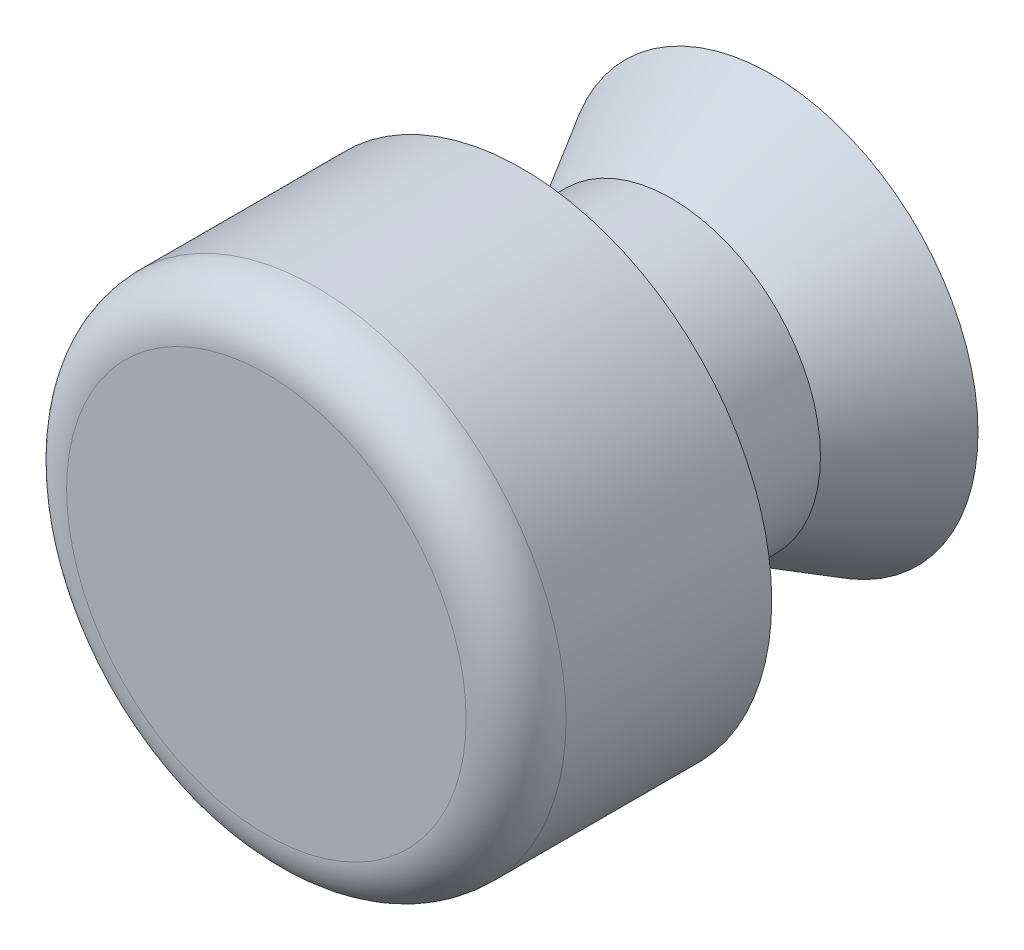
ISO-10303-21;
HEADER;
FILE_DESCRIPTION(('STEP AP214'),'2;1');
FILE_NAME('part.step','',(''),(''),'','','');
FILE_SCHEMA(('AUTOMOTIVE_DESIGN { 1 0 10303 214 1 1 1 1 }'));
ENDSEC;
DATA;
#1=APPLICATION_CONTEXT('core data for automotive mechanical design processes');
#2=APPLICATION_PROTOCOL_DEFINITION('international standard','automotive_design',2000,#1);
#3=PRODUCT_CONTEXT('',#1,'mechanical');
#4=PRODUCT('Part','Part','',(#3));
#5=PRODUCT_RELATED_PRODUCT_CATEGORY('part','',(#4));
#6=PRODUCT_DEFINITION_FORMATION('','',#4);
#7=PRODUCT_DEFINITION_CONTEXT('part definition',#1,'design');
#8=PRODUCT_DEFINITION('design','',#6,#7);
#9=PRODUCT_DEFINITION_SHAPE('','',#8);
#10=(LENGTH_UNIT() NAMED_UNIT(*) SI_UNIT(.MILLI.,.METRE.));
#11=(NAMED_UNIT(*) PLANE_ANGLE_UNIT() SI_UNIT($,.RADIAN.));
#12=(NAMED_UNIT(*) SI_UNIT($,.STERADIAN.) SOLID_ANGLE_UNIT());
#13=UNCERTAINTY_MEASURE_WITH_UNIT(LENGTH_MEASURE(1.E-05),#10,'distance_accuracy_value','');
#14=(GEOMETRIC_REPRESENTATION_CONTEXT(3) GLOBAL_UNCERTAINTY_ASSIGNED_CONTEXT((#13)) GLOBAL_UNIT_ASSIGNED_CONTEXT((#10,
#11,#12)) REPRESENTATION_CONTEXT('',''));
#15=CARTESIAN_POINT('',(0.,0.,0.));
#16=DIRECTION('',(0.,0.,1.));
#17=DIRECTION('',(1.,0.,0.));
#18=AXIS2_PLACEMENT_3D('',#15,#16,#17);
#19=CARTESIAN_POINT('',(0.,3.17499999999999,0.));
#20=DIRECTION('',(0.,0.,-1.));
#21=DIRECTION('',(-1.,0.,0.));
#22=AXIS2_PLACEMENT_3D('',#19,#20,#21);
#23=PLANE('',#22);
#24=CARTESIAN_POINT('',(0.,0.,0.));
#25=DIRECTION('',(0.,0.,1.));
#26=DIRECTION('',(1.,0.,0.));
#27=AXIS2_PLACEMENT_3D('',#24,#25,#26);
#28=CIRCLE('',#27,3.17499999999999);
#29=CARTESIAN_POINT('',(3.17499999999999,0.,0.));
#30=VERTEX_POINT('',#29);
#31=EDGE_CURVE('E55',#30,#30,#28,.T.);
#32=ORIENTED_EDGE('',*,*,#31,.T.);
#33=EDGE_LOOP('',(#32));
#34=FACE_BOUND('',#33,.T.);
#35=ADVANCED_FACE('F33',(#34),#23,.F.);
#36=CARTESIAN_POINT('',(0.,0.,-8.0264));
#37=DIRECTION('',(0.,0.,1.));
#38=DIRECTION('',(1.,0.,0.));
#39=AXIS2_PLACEMENT_3D('',#36,#37,#38);
#40=PLANE('',#39);
#41=CARTESIAN_POINT('',(0.,0.,-8.0264));
#42=DIRECTION('',(0.,0.,1.));
#43=DIRECTION('',(1.,0.,0.));
#44=AXIS2_PLACEMENT_3D('',#41,#42,#43);
#45=CIRCLE('',#44,3.28509355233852);
#46=CARTESIAN_POINT('',(3.28509355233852,0.,-8.0264));
#47=VERTEX_POINT('',#46);
#48=EDGE_CURVE('E10',#47,#47,#45,.T.);
#49=ORIENTED_EDGE('',*,*,#48,.F.);
#50=EDGE_LOOP('',(#49));
#51=FACE_BOUND('',#50,.T.);
#52=ADVANCED_FACE('F85',(#51),#40,.F.);
#53=CARTESIAN_POINT('',(0.,0.,-8.0264));
#54=DIRECTION('',(0.,0.,-1.));
#55=DIRECTION('',(-1.,0.,0.));
#56=AXIS2_PLACEMENT_3D('',#53,#54,#55);
#57=CONICAL_SURFACE('',#56,3.28509355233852,0.523598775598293);
#58=CARTESIAN_POINT('',(0.,0.,-6.4389));
#59=DIRECTION('',(0.,0.,1.));
#60=DIRECTION('',(1.,0.,0.));
#61=AXIS2_PLACEMENT_3D('',#58,#59,#60);
#62=CIRCLE('',#61,2.36855);
#63=CARTESIAN_POINT('',(2.36855,0.,-6.4389));
#64=VERTEX_POINT('',#63);
#65=EDGE_CURVE('E39',#64,#64,#62,.T.);
#66=ORIENTED_EDGE('',*,*,#65,.F.);
#67=EDGE_LOOP('',(#66));
#68=FACE_BOUND('',#67,.T.);
#69=ORIENTED_EDGE('',*,*,#48,.T.);
#70=EDGE_LOOP('',(#69));
#71=FACE_BOUND('',#70,.T.);
#72=ADVANCED_FACE('F80',(#68,#71),#57,.T.);
#73=CARTESIAN_POINT('',(0.,0.,0.));
#74=DIRECTION('',(0.,0.,1.));
#75=DIRECTION('',(1.,0.,0.));
#76=AXIS2_PLACEMENT_3D('',#73,#74,#75);
#77=CYLINDRICAL_SURFACE('',#76,2.36855);
#78=CARTESIAN_POINT('',(0.,0.,-4.064));
#79=DIRECTION('',(0.,0.,1.));
#80=DIRECTION('',(1.,0.,0.));
#81=AXIS2_PLACEMENT_3D('',#78,#79,#80);
#82=CIRCLE('',#81,2.36855);
#83=CARTESIAN_POINT('',(2.36855,0.,-4.064));
#84=VERTEX_POINT('',#83);
#85=EDGE_CURVE('E43',#84,#84,#82,.T.);
#86=ORIENTED_EDGE('',*,*,#85,.F.);
#87=EDGE_LOOP('',(#86));
#88=FACE_BOUND('',#87,.T.);
#89=ORIENTED_EDGE('',*,*,#65,.T.);
#90=EDGE_LOOP('',(#89));
#91=FACE_BOUND('',#90,.T.);
#92=ADVANCED_FACE('F75',(#88,#91),#77,.T.);
#93=CARTESIAN_POINT('',(0.,2.36855,-4.064));
#94=DIRECTION('',(0.,0.,1.));
#95=DIRECTION('',(1.,0.,0.));
#96=AXIS2_PLACEMENT_3D('',#93,#94,#95);
#97=PLANE('',#96);
#98=CARTESIAN_POINT('',(0.,0.,-4.064));
#99=DIRECTION('',(0.,0.,1.));
#100=DIRECTION('',(1.,0.,0.));
#101=AXIS2_PLACEMENT_3D('',#98,#99,#100);
#102=CIRCLE('',#101,3.96875);
#103=CARTESIAN_POINT('',(3.96875,0.,-4.064));
#104=VERTEX_POINT('',#103);
#105=EDGE_CURVE('E47',#104,#104,#102,.T.);
#106=ORIENTED_EDGE('',*,*,#105,.F.);
#107=EDGE_LOOP('',(#106));
#108=FACE_BOUND('',#107,.T.);
#109=ORIENTED_EDGE('',*,*,#85,.T.);
#110=EDGE_LOOP('',(#109));
#111=FACE_BOUND('',#110,.T.);
#112=ADVANCED_FACE('F69',(#108,#111),#97,.F.);
#113=CARTESIAN_POINT('',(0.,0.,0.));
#114=DIRECTION('',(0.,0.,1.));
#115=DIRECTION('',(1.,0.,0.));
#116=AXIS2_PLACEMENT_3D('',#113,#114,#115);
#117=CYLINDRICAL_SURFACE('',#116,3.96875);
#118=CARTESIAN_POINT('',(0.,0.,-0.793750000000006));
#119=DIRECTION('',(0.,0.,1.));
#120=DIRECTION('',(1.,0.,0.));
#121=AXIS2_PLACEMENT_3D('',#118,#119,#120);
#122=CIRCLE('',#121,3.96875);
#123=CARTESIAN_POINT('',(3.96875,0.,-0.793750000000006));
#124=VERTEX_POINT('',#123);
#125=EDGE_CURVE('E52',#124,#124,#122,.T.);
#126=ORIENTED_EDGE('',*,*,#125,.F.);
#127=EDGE_LOOP('',(#126));
#128=FACE_BOUND('',#127,.T.);
#129=ORIENTED_EDGE('',*,*,#105,.T.);
#130=EDGE_LOOP('',(#129));
#131=FACE_BOUND('',#130,.T.);
#132=ADVANCED_FACE('F63',(#128,#131),#117,.T.);
#133=CARTESIAN_POINT('',(0.,0.,-0.793750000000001));
#134=DIRECTION('',(0.,0.,1.));
#135=DIRECTION('',(1.,0.,0.));
#136=AXIS2_PLACEMENT_3D('',#133,#134,#135);
#137=TOROIDAL_SURFACE('',#136,3.175,0.79375);
#138=ORIENTED_EDGE('',*,*,#31,.F.);
#139=EDGE_LOOP('',(#138));
#140=FACE_BOUND('',#139,.T.);
#141=ORIENTED_EDGE('',*,*,#125,.T.);
#142=EDGE_LOOP('',(#141));
#143=FACE_BOUND('',#142,.T.);
#144=ADVANCED_FACE('F60',(#140,#143),#137,.T.);
#145=CLOSED_SHELL('',(#35,#52,#72,#92,#112,#132,#144));
#146=MANIFOLD_SOLID_BREP('B2',#145);
#147=ADVANCED_BREP_SHAPE_REPRESENTATION('',(#18,#146),#14);
#148=SHAPE_DEFINITION_REPRESENTATION(#9,#147);
ENDSEC;
END-ISO-10303-21;
